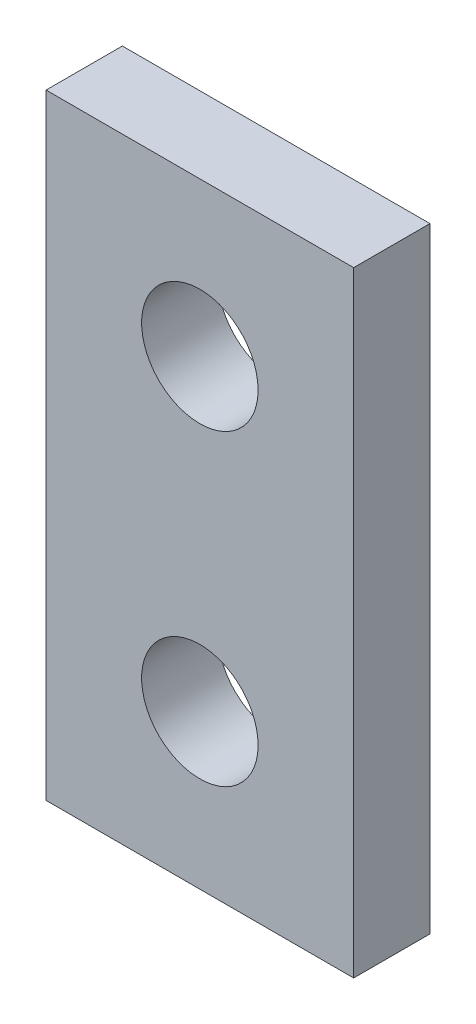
ISO-10303-21;
HEADER;
FILE_DESCRIPTION(('STEP AP214'),'2;1');
FILE_NAME('part.step','',(''),(''),'','','');
FILE_SCHEMA(('AUTOMOTIVE_DESIGN { 1 0 10303 214 1 1 1 1 }'));
ENDSEC;
DATA;
#1=APPLICATION_CONTEXT('core data for automotive mechanical design processes');
#2=APPLICATION_PROTOCOL_DEFINITION('international standard','automotive_design',2000,#1);
#3=PRODUCT_CONTEXT('',#1,'mechanical');
#4=PRODUCT('Part','Part','',(#3));
#5=PRODUCT_RELATED_PRODUCT_CATEGORY('part','',(#4));
#6=PRODUCT_DEFINITION_FORMATION('','',#4);
#7=PRODUCT_DEFINITION_CONTEXT('part definition',#1,'design');
#8=PRODUCT_DEFINITION('design','',#6,#7);
#9=PRODUCT_DEFINITION_SHAPE('','',#8);
#10=(LENGTH_UNIT() NAMED_UNIT(*) SI_UNIT(.MILLI.,.METRE.));
#11=(NAMED_UNIT(*) PLANE_ANGLE_UNIT() SI_UNIT($,.RADIAN.));
#12=(NAMED_UNIT(*) SI_UNIT($,.STERADIAN.) SOLID_ANGLE_UNIT());
#13=UNCERTAINTY_MEASURE_WITH_UNIT(LENGTH_MEASURE(1.E-05),#10,'distance_accuracy_value','');
#14=(GEOMETRIC_REPRESENTATION_CONTEXT(3) GLOBAL_UNCERTAINTY_ASSIGNED_CONTEXT((#13)) GLOBAL_UNIT_ASSIGNED_CONTEXT((#10,
#11,#12)) REPRESENTATION_CONTEXT('',''));
#15=CARTESIAN_POINT('',(0.,0.,0.));
#16=DIRECTION('',(0.,0.,1.));
#17=DIRECTION('',(1.,0.,0.));
#18=AXIS2_PLACEMENT_3D('',#15,#16,#17);
#19=CARTESIAN_POINT('',(4.7625,-9.525,-2.3622));
#20=DIRECTION('',(1.,0.,0.));
#21=DIRECTION('',(0.,0.,-1.));
#22=AXIS2_PLACEMENT_3D('',#19,#20,#21);
#23=PLANE('',#22);
#24=DIRECTION('',(0.,1.,0.));
#25=VECTOR('',#24,1.);
#26=CARTESIAN_POINT('',(4.7625,-9.525,0.));
#27=LINE('',#26,#25);
#28=CARTESIAN_POINT('',(4.7625,-9.525,0.));
#29=VERTEX_POINT('',#28);
#30=CARTESIAN_POINT('',(4.7625,9.525,0.));
#31=VERTEX_POINT('',#30);
#32=EDGE_CURVE('E99',#29,#31,#27,.T.);
#33=ORIENTED_EDGE('',*,*,#32,.F.);
#34=DIRECTION('',(0.,0.,1.));
#35=VECTOR('',#34,1.);
#36=CARTESIAN_POINT('',(4.7625,-9.525,-2.3622));
#37=LINE('',#36,#35);
#38=CARTESIAN_POINT('',(4.7625,-9.525,-2.3622));
#39=VERTEX_POINT('',#38);
#40=EDGE_CURVE('E11',#39,#29,#37,.T.);
#41=ORIENTED_EDGE('',*,*,#40,.F.);
#42=DIRECTION('',(0.,1.,0.));
#43=VECTOR('',#42,1.);
#44=CARTESIAN_POINT('',(4.7625,-9.525,-2.3622));
#45=LINE('',#44,#43);
#46=CARTESIAN_POINT('',(4.7625,9.525,-2.3622));
#47=VERTEX_POINT('',#46);
#48=EDGE_CURVE('E92',#39,#47,#45,.T.);
#49=ORIENTED_EDGE('',*,*,#48,.T.);
#50=DIRECTION('',(0.,0.,1.));
#51=VECTOR('',#50,1.);
#52=CARTESIAN_POINT('',(4.7625,9.525,-2.3622));
#53=LINE('',#52,#51);
#54=EDGE_CURVE('E37',#47,#31,#53,.T.);
#55=ORIENTED_EDGE('',*,*,#54,.T.);
#56=EDGE_LOOP('',(#33,#41,#49,#55));
#57=FACE_BOUND('',#56,.T.);
#58=ADVANCED_FACE('F34',(#57),#23,.T.);
#59=CARTESIAN_POINT('',(-4.7625,-9.525,-2.3622));
#60=DIRECTION('',(0.,-1.,0.));
#61=DIRECTION('',(0.,0.,-1.));
#62=AXIS2_PLACEMENT_3D('',#59,#60,#61);
#63=PLANE('',#62);
#64=DIRECTION('',(1.,0.,0.));
#65=VECTOR('',#64,1.);
#66=CARTESIAN_POINT('',(-4.7625,-9.525,0.));
#67=LINE('',#66,#65);
#68=CARTESIAN_POINT('',(-4.7625,-9.525,0.));
#69=VERTEX_POINT('',#68);
#70=EDGE_CURVE('E94',#69,#29,#67,.T.);
#71=ORIENTED_EDGE('',*,*,#70,.F.);
#72=DIRECTION('',(0.,0.,1.));
#73=VECTOR('',#72,1.);
#74=CARTESIAN_POINT('',(-4.7625,-9.525,-2.3622));
#75=LINE('',#74,#73);
#76=CARTESIAN_POINT('',(-4.7625,-9.525,-2.3622));
#77=VERTEX_POINT('',#76);
#78=EDGE_CURVE('E43',#77,#69,#75,.T.);
#79=ORIENTED_EDGE('',*,*,#78,.F.);
#80=DIRECTION('',(1.,0.,0.));
#81=VECTOR('',#80,1.);
#82=CARTESIAN_POINT('',(-4.7625,-9.525,-2.3622));
#83=LINE('',#82,#81);
#84=EDGE_CURVE('E89',#77,#39,#83,.T.);
#85=ORIENTED_EDGE('',*,*,#84,.T.);
#86=ORIENTED_EDGE('',*,*,#40,.T.);
#87=EDGE_LOOP('',(#71,#79,#85,#86));
#88=FACE_BOUND('',#87,.T.);
#89=ADVANCED_FACE('F110',(#88),#63,.T.);
#90=CARTESIAN_POINT('',(-4.7625,-9.525,-2.3622));
#91=DIRECTION('',(-1.,0.,0.));
#92=DIRECTION('',(0.,0.,1.));
#93=AXIS2_PLACEMENT_3D('',#90,#91,#92);
#94=PLANE('',#93);
#95=DIRECTION('',(0.,-1.,0.));
#96=VECTOR('',#95,1.);
#97=CARTESIAN_POINT('',(-4.7625,-9.525,0.));
#98=LINE('',#97,#96);
#99=CARTESIAN_POINT('',(-4.7625,9.525,0.));
#100=VERTEX_POINT('',#99);
#101=EDGE_CURVE('E84',#100,#69,#98,.T.);
#102=ORIENTED_EDGE('',*,*,#101,.F.);
#103=DIRECTION('',(0.,0.,1.));
#104=VECTOR('',#103,1.);
#105=CARTESIAN_POINT('',(-4.7625,9.525,-2.3622));
#106=LINE('',#105,#104);
#107=CARTESIAN_POINT('',(-4.7625,9.525,-2.3622));
#108=VERTEX_POINT('',#107);
#109=EDGE_CURVE('E79',#108,#100,#106,.T.);
#110=ORIENTED_EDGE('',*,*,#109,.F.);
#111=DIRECTION('',(0.,-1.,0.));
#112=VECTOR('',#111,1.);
#113=CARTESIAN_POINT('',(-4.7625,-9.525,-2.3622));
#114=LINE('',#113,#112);
#115=EDGE_CURVE('E82',#108,#77,#114,.T.);
#116=ORIENTED_EDGE('',*,*,#115,.T.);
#117=ORIENTED_EDGE('',*,*,#78,.T.);
#118=EDGE_LOOP('',(#102,#110,#116,#117));
#119=FACE_BOUND('',#118,.T.);
#120=ADVANCED_FACE('F81',(#119),#94,.T.);
#121=CARTESIAN_POINT('',(-4.7625,9.525,-2.3622));
#122=DIRECTION('',(0.,1.,0.));
#123=DIRECTION('',(0.,0.,1.));
#124=AXIS2_PLACEMENT_3D('',#121,#122,#123);
#125=PLANE('',#124);
#126=DIRECTION('',(-1.,0.,0.));
#127=VECTOR('',#126,1.);
#128=CARTESIAN_POINT('',(-4.7625,9.525,0.));
#129=LINE('',#128,#127);
#130=EDGE_CURVE('E102',#31,#100,#129,.T.);
#131=ORIENTED_EDGE('',*,*,#130,.F.);
#132=ORIENTED_EDGE('',*,*,#54,.F.);
#133=DIRECTION('',(-1.,0.,0.));
#134=VECTOR('',#133,1.);
#135=CARTESIAN_POINT('',(-4.7625,9.525,-2.3622));
#136=LINE('',#135,#134);
#137=EDGE_CURVE('E88',#47,#108,#136,.T.);
#138=ORIENTED_EDGE('',*,*,#137,.T.);
#139=ORIENTED_EDGE('',*,*,#109,.T.);
#140=EDGE_LOOP('',(#131,#132,#138,#139));
#141=FACE_BOUND('',#140,.T.);
#142=ADVANCED_FACE('F91',(#141),#125,.T.);
#143=CARTESIAN_POINT('',(0.,0.,-2.3622));
#144=DIRECTION('',(0.,0.,-1.));
#145=DIRECTION('',(-1.,0.,0.));
#146=AXIS2_PLACEMENT_3D('',#143,#144,#145);
#147=PLANE('',#146);
#148=CARTESIAN_POINT('',(0.,-4.7625,-2.3622));
#149=DIRECTION('',(0.,0.,1.));
#150=DIRECTION('',(1.,0.,0.));
#151=AXIS2_PLACEMENT_3D('',#148,#149,#150);
#152=CIRCLE('',#151,1.8034);
#153=CARTESIAN_POINT('',(1.8034,-4.7625,-2.3622));
#154=VERTEX_POINT('',#153);
#155=EDGE_CURVE('E143',#154,#154,#152,.T.);
#156=ORIENTED_EDGE('',*,*,#155,.T.);
#157=EDGE_LOOP('',(#156));
#158=FACE_BOUND('',#157,.T.);
#159=CARTESIAN_POINT('',(0.,4.7625,-2.3622));
#160=DIRECTION('',(0.,0.,1.));
#161=DIRECTION('',(1.,0.,0.));
#162=AXIS2_PLACEMENT_3D('',#159,#160,#161);
#163=CIRCLE('',#162,1.8034);
#164=CARTESIAN_POINT('',(1.8034,4.7625,-2.3622));
#165=VERTEX_POINT('',#164);
#166=EDGE_CURVE('E103',#165,#165,#163,.T.);
#167=ORIENTED_EDGE('',*,*,#166,.T.);
#168=EDGE_LOOP('',(#167));
#169=FACE_BOUND('',#168,.T.);
#170=ORIENTED_EDGE('',*,*,#48,.F.);
#171=ORIENTED_EDGE('',*,*,#84,.F.);
#172=ORIENTED_EDGE('',*,*,#115,.F.);
#173=ORIENTED_EDGE('',*,*,#137,.F.);
#174=EDGE_LOOP('',(#170,#171,#172,#173));
#175=FACE_BOUND('',#174,.T.);
#176=ADVANCED_FACE('F87',(#158,#169,#175),#147,.T.);
#177=CARTESIAN_POINT('',(0.,0.,0.));
#178=DIRECTION('',(0.,0.,-1.));
#179=DIRECTION('',(-1.,0.,0.));
#180=AXIS2_PLACEMENT_3D('',#177,#178,#179);
#181=PLANE('',#180);
#182=CARTESIAN_POINT('',(0.,-4.7625,0.));
#183=DIRECTION('',(0.,0.,1.));
#184=DIRECTION('',(1.,0.,0.));
#185=AXIS2_PLACEMENT_3D('',#182,#183,#184);
#186=CIRCLE('',#185,1.8034);
#187=CARTESIAN_POINT('',(1.8034,-4.7625,0.));
#188=VERTEX_POINT('',#187);
#189=EDGE_CURVE('E146',#188,#188,#186,.T.);
#190=ORIENTED_EDGE('',*,*,#189,.F.);
#191=EDGE_LOOP('',(#190));
#192=FACE_BOUND('',#191,.T.);
#193=CARTESIAN_POINT('',(0.,4.7625,0.));
#194=DIRECTION('',(0.,0.,1.));
#195=DIRECTION('',(1.,0.,0.));
#196=AXIS2_PLACEMENT_3D('',#193,#194,#195);
#197=CIRCLE('',#196,1.8034);
#198=CARTESIAN_POINT('',(1.8034,4.7625,0.));
#199=VERTEX_POINT('',#198);
#200=EDGE_CURVE('E148',#199,#199,#197,.T.);
#201=ORIENTED_EDGE('',*,*,#200,.F.);
#202=EDGE_LOOP('',(#201));
#203=FACE_BOUND('',#202,.T.);
#204=ORIENTED_EDGE('',*,*,#32,.T.);
#205=ORIENTED_EDGE('',*,*,#130,.T.);
#206=ORIENTED_EDGE('',*,*,#101,.T.);
#207=ORIENTED_EDGE('',*,*,#70,.T.);
#208=EDGE_LOOP('',(#204,#205,#206,#207));
#209=FACE_BOUND('',#208,.T.);
#210=ADVANCED_FACE('F109',(#192,#203,#209),#181,.F.);
#211=CARTESIAN_POINT('',(0.,4.7625,-2.3622));
#212=DIRECTION('',(0.,0.,1.));
#213=DIRECTION('',(1.,0.,0.));
#214=AXIS2_PLACEMENT_3D('',#211,#212,#213);
#215=CYLINDRICAL_SURFACE('',#214,1.8034);
#216=ORIENTED_EDGE('',*,*,#166,.F.);
#217=EDGE_LOOP('',(#216));
#218=FACE_BOUND('',#217,.T.);
#219=ORIENTED_EDGE('',*,*,#200,.T.);
#220=EDGE_LOOP('',(#219));
#221=FACE_BOUND('',#220,.T.);
#222=ADVANCED_FACE('F128',(#218,#221),#215,.F.);
#223=CARTESIAN_POINT('',(0.,-4.7625,-2.3622));
#224=DIRECTION('',(0.,0.,1.));
#225=DIRECTION('',(1.,0.,0.));
#226=AXIS2_PLACEMENT_3D('',#223,#224,#225);
#227=CYLINDRICAL_SURFACE('',#226,1.8034);
#228=ORIENTED_EDGE('',*,*,#155,.F.);
#229=EDGE_LOOP('',(#228));
#230=FACE_BOUND('',#229,.T.);
#231=ORIENTED_EDGE('',*,*,#189,.T.);
#232=EDGE_LOOP('',(#231));
#233=FACE_BOUND('',#232,.T.);
#234=ADVANCED_FACE('F135',(#230,#233),#227,.F.);
#235=CLOSED_SHELL('',(#58,#89,#120,#142,#176,#210,#222,#234));
#236=MANIFOLD_SOLID_BREP('B2',#235);
#237=ADVANCED_BREP_SHAPE_REPRESENTATION('',(#18,#236),#14);
#238=SHAPE_DEFINITION_REPRESENTATION(#9,#237);
ENDSEC;
END-ISO-10303-21;
